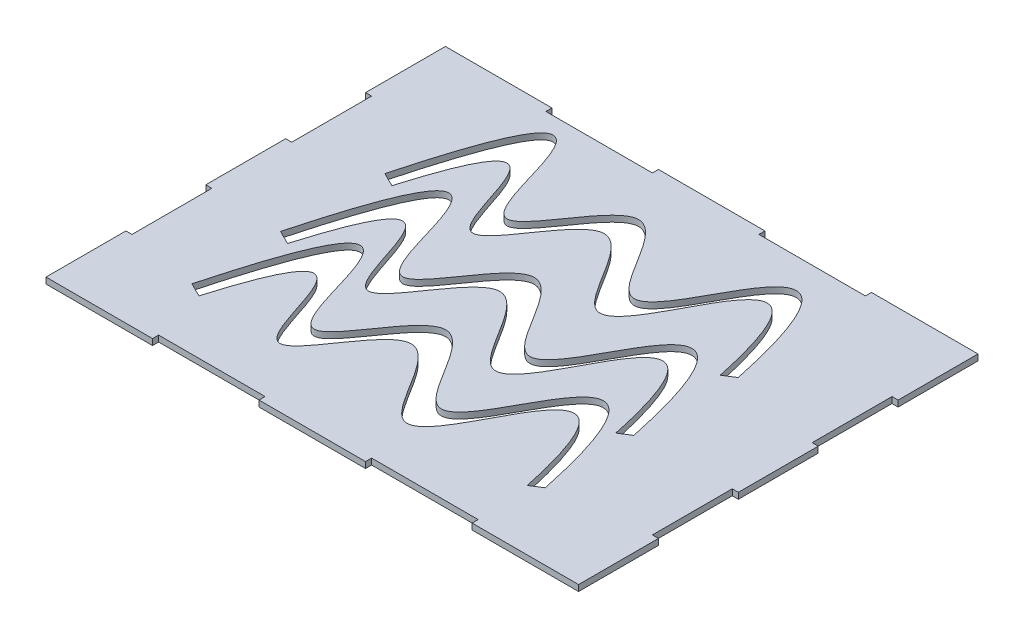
from build123d import *

# Parameters (mm, degrees)
BOSS_EXTRUDE2_DEPTH = 2.28
CUT_EXTRUDE1_DEPTH  = 10


with BuildPart() as part:
    # Sketch2 → Boss-Extrude2 (new body)
    with BuildSketch(Plane(origin=(0, 0, 0), x_dir=(1, 0, 0), z_dir=(0, 1, 0))):
        Polygon((-100, -45), (-97.72, -45), (-97.72, -15), (-100, -15), (-100, 15), (-97.72, 15), (-97.72, 45), (-100, 45), (-100, 75), (-60, 75), (-60, 72.72), (-20, 72.72), (-20, 75), (20, 75), (20, 72.72), (60, 72.72), (60, 75), (100, 75), (100, 45), (97.72, 45), (97.72, 15), (100, 15), (100, -15), (97.72, -15), (97.72, -45), (100, -45), (100, -75), (60, -75), (60, -72.72), (20, -72.72), (20, -75), (-20, -75), (-20, -72.72), (-60, -72.72), (-60, -75), (-100, -75), align=None)
    extrude(amount=BOSS_EXTRUDE2_DEPTH)

    # Sketch3 → Cut-Extrude1 (cut)
    with BuildSketch(Plane(origin=(0, 2.28, 0), x_dir=(1, 0, 0), z_dir=(0, 1, 0))):
        with BuildLine():
            Line((-70.02304825, 22.289473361), (-64.776994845, 19.666446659))
            add(Edge.make_bspline(
                [(-64.776994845, 19.666446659), (-45.667600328, 84.334128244), (-43.396009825, -19.931837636), (-8.336918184, 68.662516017), (22.529048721, -29.048173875), (42.307285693, 95.692549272), (58.505260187, 19.666446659)],
                knots=[0, 0, 0, 0, 0.279177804, 0.456782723, 0.640081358, 1, 1, 1, 1], degree=3))
            Line((58.505260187, 19.666446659), (62.658385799, 22.289473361))
            add(Edge.make_bspline(
                [(-70.02304825, 22.289473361), (-44.825367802, 116.568955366), (-44.182883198, -15.143872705), (-6.264913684, 79.59058742), (24.180757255, -17.938063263), (44.249802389, 108.363150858), (62.658385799, 22.289473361)],
                knots=[0, 0, 0, 0, 0.320698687, 0.490092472, 0.664916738, 1, 1, 1, 1], degree=3))
        make_face()
        with BuildLine():
            Line((-70.809962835, -16.117253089), (-65.563909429, -18.740279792))
            add(Edge.make_bspline(
                [(-65.563909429, -18.740279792), (-46.454514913, 45.927401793), (-44.18292441, -58.338564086), (-9.123832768, 30.255789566), (21.742134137, -67.454900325), (41.520371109, 57.285822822), (57.718345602, -18.740279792)],
                knots=[0, 0, 0, 0, 0.279177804, 0.456782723, 0.640081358, 1, 1, 1, 1], degree=3))
            Line((57.718345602, -18.740279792), (61.871471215, -16.117253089))
            add(Edge.make_bspline(
                [(-70.809962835, -16.117253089), (-45.612282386, 78.162228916), (-44.969797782, -53.550599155), (-7.051828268, 41.18386097), (23.39384267, -56.344789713), (43.462887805, 69.956424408), (61.871471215, -16.117253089)],
                knots=[0, 0, 0, 0, 0.320698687, 0.490092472, 0.664916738, 1, 1, 1, 1], degree=3))
        make_face()
        with BuildLine():
            Line((-70.41072579, -49.786030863), (-65.164672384, -52.409057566))
            add(Edge.make_bspline(
                [(-65.164672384, -52.409057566), (-46.055277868, 12.258624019), (-43.783687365, -92.00734186), (-8.724595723, -3.412988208), (22.141371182, -101.123678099), (41.919608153, 23.617045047), (58.117582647, -52.409057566)],
                knots=[0, 0, 0, 0, 0.279177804, 0.456782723, 0.640081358, 1, 1, 1, 1], degree=3))
            Line((58.117582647, -52.409057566), (62.27070826, -49.786030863))
            add(Edge.make_bspline(
                [(-70.41072579, -49.786030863), (-45.213045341, 44.493451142), (-44.570560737, -87.21937693), (-6.652591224, 7.515083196), (23.793079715, -90.013567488), (43.862124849, 36.287646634), (62.27070826, -49.786030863)],
                knots=[0, 0, 0, 0, 0.320698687, 0.490092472, 0.664916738, 1, 1, 1, 1], degree=3))
        make_face()
    extrude(amount=-CUT_EXTRUDE1_DEPTH, mode=Mode.SUBTRACT)


solid = part.part
